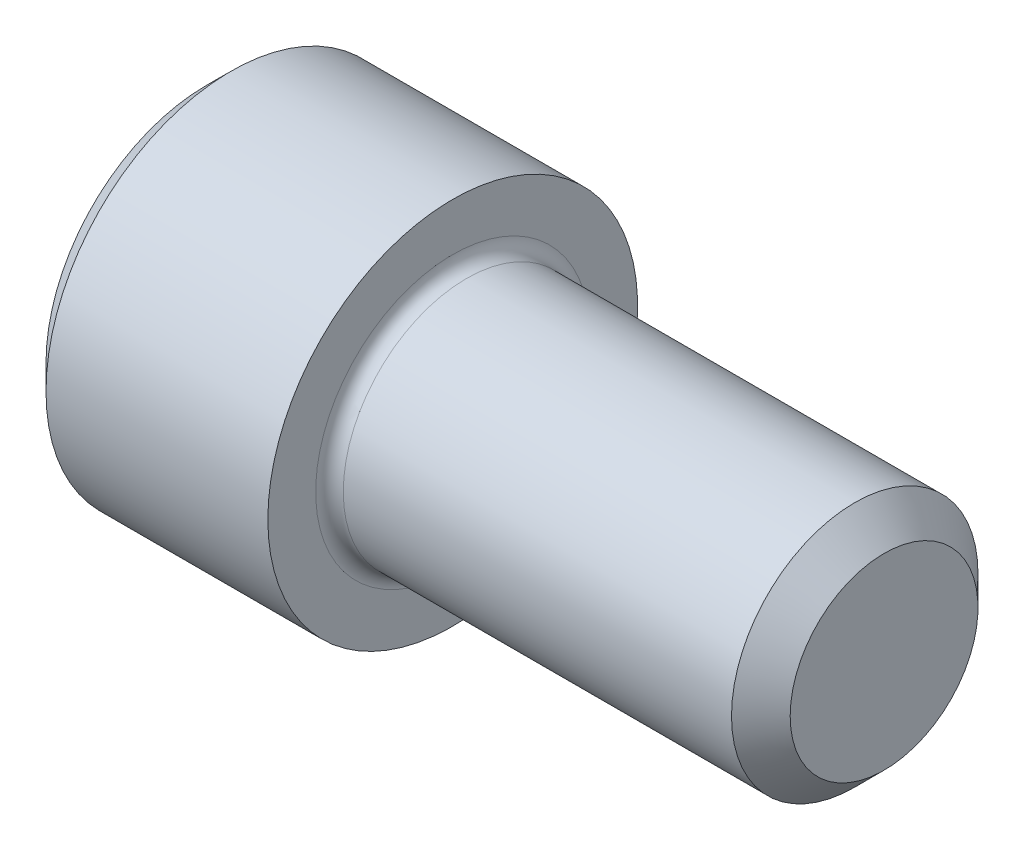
from build123d import *

# Parameters (mm, degrees)
FILLET1_R   = 0.3556
HEX_2_DEPTH = 3.048


with BuildPart() as part:
    # BodySke → Base-Revolve (revolve)
    with BuildSketch(Plane.XY, mode=Mode.PRIVATE) as base_revolve_sk:
        Polygon((0, 0), (0, 4.1275), (0.635, 4.7625), (6.35, 4.7625), (6.35, 3.175), (16.70685, 3.175), (17.4625, 2.41935), (17.4625, 0), align=None)
    revolve(base_revolve_sk.sketch.rotate(Axis((-31.75, 0, 0), (1, 0, 0)), 90), axis=Axis((-31.75, 0, 0), (1, 0, 0)))

    # Fillet1
    fillet1_edges = [part.edges().sort_by_distance(p)[0] for p in [
        (6.35, 0, -3.175),
    ]]
    fillet(fillet1_edges, radius=FILLET1_R)

    # Sketch2 → Hex-PreBroach (revolve, cut)
    with BuildSketch(Plane.XY, mode=Mode.PRIVATE) as hex_prebroach_sk:
        Polygon((0, 2.38125), (3.048, 2.38125), (4.422815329, 0), (0, 0), align=None)
    revolve(hex_prebroach_sk.sketch.rotate(Axis((0, 0, 0), (1, 0, 0)), 90), axis=Axis((0, 0, 0), (1, 0, 0)), mode=Mode.SUBTRACT)

    # Sketch3 → Hex 2 (cut)
    with BuildSketch(Plane(origin=(0, 0, 0), x_dir=(0, 0.500000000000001, 0.866025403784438), z_dir=(-1, 0, 0))):
        Polygon((1.374815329, 2.38125), (-1.374815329, 2.38125), (-2.749630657, 0), (-1.374815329, -2.38125), (1.374815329, -2.38125), (2.749630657, 0), align=None)
    extrude(amount=-HEX_2_DEPTH, mode=Mode.SUBTRACT)


solid = part.part
